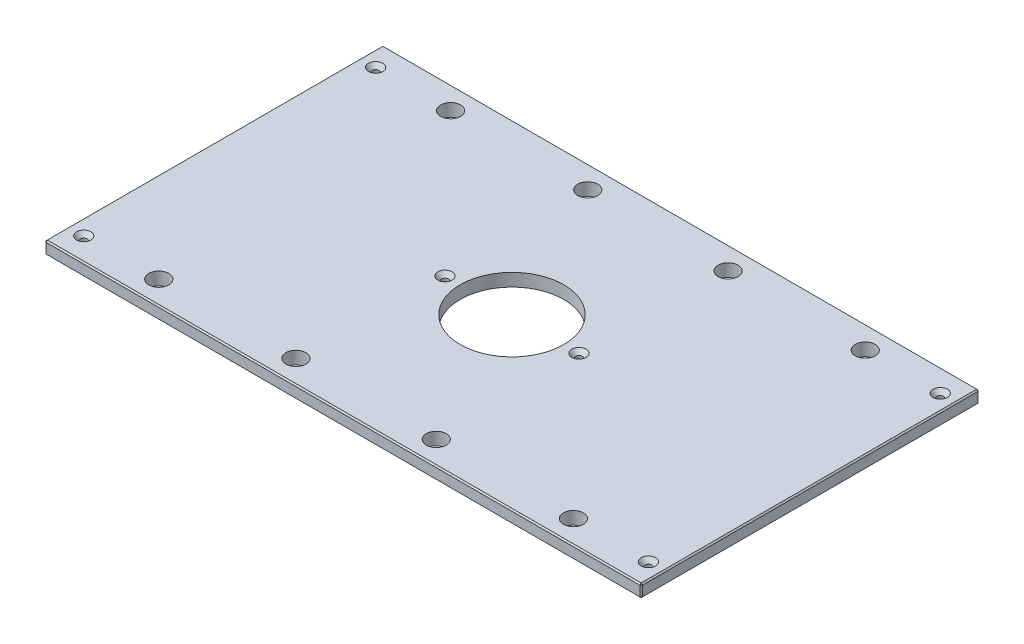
ISO-10303-21;
HEADER;
FILE_DESCRIPTION(('STEP AP214'),'2;1');
FILE_NAME('part.step','',(''),(''),'','','');
FILE_SCHEMA(('AUTOMOTIVE_DESIGN { 1 0 10303 214 1 1 1 1 }'));
ENDSEC;
DATA;
#1=APPLICATION_CONTEXT('core data for automotive mechanical design processes');
#2=APPLICATION_PROTOCOL_DEFINITION('international standard','automotive_design',2000,#1);
#3=PRODUCT_CONTEXT('',#1,'mechanical');
#4=PRODUCT('Part','Part','',(#3));
#5=PRODUCT_RELATED_PRODUCT_CATEGORY('part','',(#4));
#6=PRODUCT_DEFINITION_FORMATION('','',#4);
#7=PRODUCT_DEFINITION_CONTEXT('part definition',#1,'design');
#8=PRODUCT_DEFINITION('design','',#6,#7);
#9=PRODUCT_DEFINITION_SHAPE('','',#8);
#10=(LENGTH_UNIT() NAMED_UNIT(*) SI_UNIT(.MILLI.,.METRE.));
#11=(NAMED_UNIT(*) PLANE_ANGLE_UNIT() SI_UNIT($,.RADIAN.));
#12=(NAMED_UNIT(*) SI_UNIT($,.STERADIAN.) SOLID_ANGLE_UNIT());
#13=UNCERTAINTY_MEASURE_WITH_UNIT(LENGTH_MEASURE(1.E-05),#10,'distance_accuracy_value','');
#14=(GEOMETRIC_REPRESENTATION_CONTEXT(3) GLOBAL_UNCERTAINTY_ASSIGNED_CONTEXT((#13)) GLOBAL_UNIT_ASSIGNED_CONTEXT((#10,
#11,#12)) REPRESENTATION_CONTEXT('',''));
#15=CARTESIAN_POINT('',(0.,0.,0.));
#16=DIRECTION('',(0.,0.,1.));
#17=DIRECTION('',(1.,0.,0.));
#18=AXIS2_PLACEMENT_3D('',#15,#16,#17);
#19=CARTESIAN_POINT('',(-296.8625,12.7,-168.275));
#20=DIRECTION('',(1.,0.,0.));
#21=DIRECTION('',(0.,0.,-1.));
#22=AXIS2_PLACEMENT_3D('',#19,#20,#21);
#23=PLANE('',#22);
#24=DIRECTION('',(0.,0.,-1.));
#25=VECTOR('',#24,1.);
#26=CARTESIAN_POINT('',(-296.8625,11.43,-168.275));
#27=LINE('',#26,#25);
#28=CARTESIAN_POINT('',(-296.8625,11.43,167.005));
#29=VERTEX_POINT('',#28);
#30=CARTESIAN_POINT('',(-296.8625,11.43,-167.005));
#31=VERTEX_POINT('',#30);
#32=EDGE_CURVE('E135',#29,#31,#27,.T.);
#33=ORIENTED_EDGE('',*,*,#32,.T.);
#34=DIRECTION('',(0.,-1.,0.));
#35=VECTOR('',#34,1.);
#36=CARTESIAN_POINT('',(-296.8625,12.7,-167.005));
#37=LINE('',#36,#35);
#38=CARTESIAN_POINT('',(-296.8625,1.26999999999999,-167.005));
#39=VERTEX_POINT('',#38);
#40=EDGE_CURVE('E131',#31,#39,#37,.T.);
#41=ORIENTED_EDGE('',*,*,#40,.T.);
#42=DIRECTION('',(0.,0.,1.));
#43=VECTOR('',#42,1.);
#44=CARTESIAN_POINT('',(-296.8625,1.26999999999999,-168.275));
#45=LINE('',#44,#43);
#46=CARTESIAN_POINT('',(-296.8625,1.26999999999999,167.005));
#47=VERTEX_POINT('',#46);
#48=EDGE_CURVE('E126',#39,#47,#45,.T.);
#49=ORIENTED_EDGE('',*,*,#48,.T.);
#50=DIRECTION('',(0.,1.,0.));
#51=VECTOR('',#50,1.);
#52=CARTESIAN_POINT('',(-296.8625,12.7,167.005));
#53=LINE('',#52,#51);
#54=EDGE_CURVE('E128',#47,#29,#53,.T.);
#55=ORIENTED_EDGE('',*,*,#54,.T.);
#56=EDGE_LOOP('',(#33,#41,#49,#55));
#57=FACE_BOUND('',#56,.T.);
#58=ADVANCED_FACE('F35',(#57),#23,.F.);
#59=CARTESIAN_POINT('',(-296.8625,12.7,168.275));
#60=DIRECTION('',(0.,0.,-1.));
#61=DIRECTION('',(-1.,0.,0.));
#62=AXIS2_PLACEMENT_3D('',#59,#60,#61);
#63=PLANE('',#62);
#64=DIRECTION('',(1.,0.,0.));
#65=VECTOR('',#64,1.);
#66=CARTESIAN_POINT('',(-296.8625,1.26999999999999,168.275));
#67=LINE('',#66,#65);
#68=CARTESIAN_POINT('',(-295.5925,1.26999999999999,168.275));
#69=VERTEX_POINT('',#68);
#70=CARTESIAN_POINT('',(295.5925,1.26999999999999,168.275));
#71=VERTEX_POINT('',#70);
#72=EDGE_CURVE('E58',#69,#71,#67,.T.);
#73=ORIENTED_EDGE('',*,*,#72,.T.);
#74=DIRECTION('',(0.,1.,0.));
#75=VECTOR('',#74,1.);
#76=CARTESIAN_POINT('',(295.5925,12.7,168.275));
#77=LINE('',#76,#75);
#78=CARTESIAN_POINT('',(295.5925,11.43,168.275));
#79=VERTEX_POINT('',#78);
#80=EDGE_CURVE('E11',#71,#79,#77,.T.);
#81=ORIENTED_EDGE('',*,*,#80,.T.);
#82=DIRECTION('',(-1.,0.,0.));
#83=VECTOR('',#82,1.);
#84=CARTESIAN_POINT('',(-296.8625,11.43,168.275));
#85=LINE('',#84,#83);
#86=CARTESIAN_POINT('',(-295.5925,11.43,168.275));
#87=VERTEX_POINT('',#86);
#88=EDGE_CURVE('E44',#79,#87,#85,.T.);
#89=ORIENTED_EDGE('',*,*,#88,.T.);
#90=DIRECTION('',(0.,-1.,0.));
#91=VECTOR('',#90,1.);
#92=CARTESIAN_POINT('',(-295.5925,12.7,168.275));
#93=LINE('',#92,#91);
#94=EDGE_CURVE('E303',#87,#69,#93,.T.);
#95=ORIENTED_EDGE('',*,*,#94,.T.);
#96=EDGE_LOOP('',(#73,#81,#89,#95));
#97=FACE_BOUND('',#96,.T.);
#98=ADVANCED_FACE('F372',(#97),#63,.F.);
#99=CARTESIAN_POINT('',(296.8625,12.7,-168.275));
#100=DIRECTION('',(-1.,0.,0.));
#101=DIRECTION('',(0.,0.,1.));
#102=AXIS2_PLACEMENT_3D('',#99,#100,#101);
#103=PLANE('',#102);
#104=DIRECTION('',(0.,0.,-1.));
#105=VECTOR('',#104,1.);
#106=CARTESIAN_POINT('',(296.8625,1.26999999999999,-168.275));
#107=LINE('',#106,#105);
#108=CARTESIAN_POINT('',(296.8625,1.26999999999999,167.005));
#109=VERTEX_POINT('',#108);
#110=CARTESIAN_POINT('',(296.8625,1.26999999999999,-167.005));
#111=VERTEX_POINT('',#110);
#112=EDGE_CURVE('E298',#109,#111,#107,.T.);
#113=ORIENTED_EDGE('',*,*,#112,.T.);
#114=DIRECTION('',(0.,1.,0.));
#115=VECTOR('',#114,1.);
#116=CARTESIAN_POINT('',(296.8625,12.7,-167.005));
#117=LINE('',#116,#115);
#118=CARTESIAN_POINT('',(296.8625,11.43,-167.005));
#119=VERTEX_POINT('',#118);
#120=EDGE_CURVE('E300',#111,#119,#117,.T.);
#121=ORIENTED_EDGE('',*,*,#120,.T.);
#122=DIRECTION('',(0.,0.,1.));
#123=VECTOR('',#122,1.);
#124=CARTESIAN_POINT('',(296.8625,11.43,168.275));
#125=LINE('',#124,#123);
#126=CARTESIAN_POINT('',(296.8625,11.43,167.005));
#127=VERTEX_POINT('',#126);
#128=EDGE_CURVE('E296',#119,#127,#125,.T.);
#129=ORIENTED_EDGE('',*,*,#128,.T.);
#130=DIRECTION('',(0.,-1.,0.));
#131=VECTOR('',#130,1.);
#132=CARTESIAN_POINT('',(296.8625,12.7,167.005));
#133=LINE('',#132,#131);
#134=EDGE_CURVE('E294',#127,#109,#133,.T.);
#135=ORIENTED_EDGE('',*,*,#134,.T.);
#136=EDGE_LOOP('',(#113,#121,#129,#135));
#137=FACE_BOUND('',#136,.T.);
#138=ADVANCED_FACE('F359',(#137),#103,.F.);
#139=CARTESIAN_POINT('',(-296.8625,12.7,-168.275));
#140=DIRECTION('',(0.,0.,1.));
#141=DIRECTION('',(1.,0.,0.));
#142=AXIS2_PLACEMENT_3D('',#139,#140,#141);
#143=PLANE('',#142);
#144=DIRECTION('',(-1.,0.,0.));
#145=VECTOR('',#144,1.);
#146=CARTESIAN_POINT('',(-296.8625,1.26999999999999,-168.275));
#147=LINE('',#146,#145);
#148=CARTESIAN_POINT('',(295.5925,1.26999999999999,-168.275));
#149=VERTEX_POINT('',#148);
#150=CARTESIAN_POINT('',(-295.5925,1.26999999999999,-168.275));
#151=VERTEX_POINT('',#150);
#152=EDGE_CURVE('E270',#149,#151,#147,.T.);
#153=ORIENTED_EDGE('',*,*,#152,.T.);
#154=DIRECTION('',(0.,1.,0.));
#155=VECTOR('',#154,1.);
#156=CARTESIAN_POINT('',(-295.5925,12.7,-168.275));
#157=LINE('',#156,#155);
#158=CARTESIAN_POINT('',(-295.5925,11.43,-168.275));
#159=VERTEX_POINT('',#158);
#160=EDGE_CURVE('E274',#151,#159,#157,.T.);
#161=ORIENTED_EDGE('',*,*,#160,.T.);
#162=DIRECTION('',(1.,0.,0.));
#163=VECTOR('',#162,1.);
#164=CARTESIAN_POINT('',(296.8625,11.43,-168.275));
#165=LINE('',#164,#163);
#166=CARTESIAN_POINT('',(295.5925,11.43,-168.275));
#167=VERTEX_POINT('',#166);
#168=EDGE_CURVE('E272',#159,#167,#165,.T.);
#169=ORIENTED_EDGE('',*,*,#168,.T.);
#170=DIRECTION('',(0.,-1.,0.));
#171=VECTOR('',#170,1.);
#172=CARTESIAN_POINT('',(295.5925,12.7,-168.275));
#173=LINE('',#172,#171);
#174=EDGE_CURVE('E268',#167,#149,#173,.T.);
#175=ORIENTED_EDGE('',*,*,#174,.T.);
#176=EDGE_LOOP('',(#153,#161,#169,#175));
#177=FACE_BOUND('',#176,.T.);
#178=ADVANCED_FACE('F333',(#177),#143,.F.);
#179=CARTESIAN_POINT('',(0.,12.7,0.));
#180=DIRECTION('',(0.,1.,0.));
#181=DIRECTION('',(0.,0.,1.));
#182=AXIS2_PLACEMENT_3D('',#179,#180,#181);
#183=PLANE('',#182);
#184=CARTESIAN_POINT('',(280.9875,12.7,-145.25498));
#185=DIRECTION('',(0.,1.,0.));
#186=DIRECTION('',(0.,0.,1.));
#187=AXIS2_PLACEMENT_3D('',#184,#185,#186);
#188=CIRCLE('',#187,7.13740000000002);
#189=CARTESIAN_POINT('',(280.9875,12.7,-138.11758));
#190=VERTEX_POINT('',#189);
#191=EDGE_CURVE('E816',#190,#190,#188,.T.);
#192=ORIENTED_EDGE('',*,*,#191,.F.);
#193=EDGE_LOOP('',(#192));
#194=FACE_BOUND('',#193,.T.);
#195=CARTESIAN_POINT('',(280.9875,12.7,145.25498));
#196=DIRECTION('',(0.,1.,0.));
#197=DIRECTION('',(0.,0.,1.));
#198=AXIS2_PLACEMENT_3D('',#195,#196,#197);
#199=CIRCLE('',#198,7.13740000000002);
#200=CARTESIAN_POINT('',(280.9875,12.7,152.39238));
#201=VERTEX_POINT('',#200);
#202=EDGE_CURVE('E820',#201,#201,#199,.T.);
#203=ORIENTED_EDGE('',*,*,#202,.F.);
#204=EDGE_LOOP('',(#203));
#205=FACE_BOUND('',#204,.T.);
#206=CARTESIAN_POINT('',(-280.9875,12.7,145.25498));
#207=DIRECTION('',(0.,1.,0.));
#208=DIRECTION('',(0.,0.,1.));
#209=AXIS2_PLACEMENT_3D('',#206,#207,#208);
#210=CIRCLE('',#209,7.13740000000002);
#211=CARTESIAN_POINT('',(-280.9875,12.7,152.39238));
#212=VERTEX_POINT('',#211);
#213=EDGE_CURVE('E824',#212,#212,#210,.T.);
#214=ORIENTED_EDGE('',*,*,#213,.F.);
#215=EDGE_LOOP('',(#214));
#216=FACE_BOUND('',#215,.T.);
#217=CARTESIAN_POINT('',(-66.675,12.7,0.));
#218=DIRECTION('',(0.,1.,0.));
#219=DIRECTION('',(0.,0.,1.));
#220=AXIS2_PLACEMENT_3D('',#217,#218,#219);
#221=CIRCLE('',#220,7.1374);
#222=CARTESIAN_POINT('',(-66.675,12.7,7.1374));
#223=VERTEX_POINT('',#222);
#224=EDGE_CURVE('E828',#223,#223,#221,.T.);
#225=ORIENTED_EDGE('',*,*,#224,.F.);
#226=EDGE_LOOP('',(#225));
#227=FACE_BOUND('',#226,.T.);
#228=CARTESIAN_POINT('',(66.675,12.7,0.));
#229=DIRECTION('',(0.,1.,0.));
#230=DIRECTION('',(0.,0.,1.));
#231=AXIS2_PLACEMENT_3D('',#228,#229,#230);
#232=CIRCLE('',#231,7.1374);
#233=CARTESIAN_POINT('',(66.675,12.7,7.1374));
#234=VERTEX_POINT('',#233);
#235=EDGE_CURVE('E832',#234,#234,#232,.T.);
#236=ORIENTED_EDGE('',*,*,#235,.F.);
#237=EDGE_LOOP('',(#236));
#238=FACE_BOUND('',#237,.T.);
#239=CARTESIAN_POINT('',(-280.9875,12.7,-145.25498));
#240=DIRECTION('',(0.,1.,0.));
#241=DIRECTION('',(0.,0.,1.));
#242=AXIS2_PLACEMENT_3D('',#239,#240,#241);
#243=CIRCLE('',#242,7.13740000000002);
#244=CARTESIAN_POINT('',(-280.9875,12.7,-138.11758));
#245=VERTEX_POINT('',#244);
#246=EDGE_CURVE('E835',#245,#245,#243,.T.);
#247=ORIENTED_EDGE('',*,*,#246,.F.);
#248=EDGE_LOOP('',(#247));
#249=FACE_BOUND('',#248,.T.);
#250=DIRECTION('',(0.,0.,-1.));
#251=VECTOR('',#250,1.);
#252=CARTESIAN_POINT('',(295.5925,12.7,-168.275));
#253=LINE('',#252,#251);
#254=CARTESIAN_POINT('',(295.5925,12.7,167.005));
#255=VERTEX_POINT('',#254);
#256=CARTESIAN_POINT('',(295.5925,12.7,-167.005));
#257=VERTEX_POINT('',#256);
#258=EDGE_CURVE('E281',#255,#257,#253,.T.);
#259=ORIENTED_EDGE('',*,*,#258,.T.);
#260=DIRECTION('',(-1.,0.,0.));
#261=VECTOR('',#260,1.);
#262=CARTESIAN_POINT('',(-296.8625,12.7,-167.005));
#263=LINE('',#262,#261);
#264=CARTESIAN_POINT('',(-295.5925,12.7,-167.005));
#265=VERTEX_POINT('',#264);
#266=EDGE_CURVE('E283',#257,#265,#263,.T.);
#267=ORIENTED_EDGE('',*,*,#266,.T.);
#268=DIRECTION('',(0.,0.,1.));
#269=VECTOR('',#268,1.);
#270=CARTESIAN_POINT('',(-295.5925,12.7,168.275));
#271=LINE('',#270,#269);
#272=CARTESIAN_POINT('',(-295.5925,12.7,167.005));
#273=VERTEX_POINT('',#272);
#274=EDGE_CURVE('E279',#265,#273,#271,.T.);
#275=ORIENTED_EDGE('',*,*,#274,.T.);
#276=DIRECTION('',(1.,0.,0.));
#277=VECTOR('',#276,1.);
#278=CARTESIAN_POINT('',(296.8625,12.7,167.005));
#279=LINE('',#278,#277);
#280=EDGE_CURVE('E277',#273,#255,#279,.T.);
#281=ORIENTED_EDGE('',*,*,#280,.T.);
#282=EDGE_LOOP('',(#259,#267,#275,#281));
#283=FACE_BOUND('',#282,.T.);
#284=CARTESIAN_POINT('',(206.375,12.7,-145.25498));
#285=DIRECTION('',(0.,1.,0.));
#286=DIRECTION('',(0.,0.,1.));
#287=AXIS2_PLACEMENT_3D('',#284,#285,#286);
#288=CIRCLE('',#287,9.921875);
#289=CARTESIAN_POINT('',(206.375,12.7,-135.333105));
#290=VERTEX_POINT('',#289);
#291=EDGE_CURVE('E204',#290,#290,#288,.T.);
#292=ORIENTED_EDGE('',*,*,#291,.F.);
#293=EDGE_LOOP('',(#292));
#294=FACE_BOUND('',#293,.T.);
#295=CARTESIAN_POINT('',(-206.375,12.7,-145.25498));
#296=DIRECTION('',(0.,1.,0.));
#297=DIRECTION('',(0.,0.,1.));
#298=AXIS2_PLACEMENT_3D('',#295,#296,#297);
#299=CIRCLE('',#298,9.921875);
#300=CARTESIAN_POINT('',(-206.375,12.7,-135.333105));
#301=VERTEX_POINT('',#300);
#302=EDGE_CURVE('E214',#301,#301,#299,.T.);
#303=ORIENTED_EDGE('',*,*,#302,.F.);
#304=EDGE_LOOP('',(#303));
#305=FACE_BOUND('',#304,.T.);
#306=CARTESIAN_POINT('',(206.375,12.7,145.25498));
#307=DIRECTION('',(0.,1.,0.));
#308=DIRECTION('',(0.,0.,1.));
#309=AXIS2_PLACEMENT_3D('',#306,#307,#308);
#310=CIRCLE('',#309,9.921875);
#311=CARTESIAN_POINT('',(206.375,12.7,155.176855));
#312=VERTEX_POINT('',#311);
#313=EDGE_CURVE('E225',#312,#312,#310,.T.);
#314=ORIENTED_EDGE('',*,*,#313,.F.);
#315=EDGE_LOOP('',(#314));
#316=FACE_BOUND('',#315,.T.);
#317=CARTESIAN_POINT('',(-206.375,12.7,145.25498));
#318=DIRECTION('',(0.,1.,0.));
#319=DIRECTION('',(0.,0.,1.));
#320=AXIS2_PLACEMENT_3D('',#317,#318,#319);
#321=CIRCLE('',#320,9.921875);
#322=CARTESIAN_POINT('',(-206.375,12.7,155.176855));
#323=VERTEX_POINT('',#322);
#324=EDGE_CURVE('E231',#323,#323,#321,.T.);
#325=ORIENTED_EDGE('',*,*,#324,.F.);
#326=EDGE_LOOP('',(#325));
#327=FACE_BOUND('',#326,.T.);
#328=CARTESIAN_POINT('',(-69.85,12.7,-145.25498));
#329=DIRECTION('',(0.,1.,0.));
#330=DIRECTION('',(0.,0.,1.));
#331=AXIS2_PLACEMENT_3D('',#328,#329,#330);
#332=CIRCLE('',#331,9.921875);
#333=CARTESIAN_POINT('',(-69.85,12.7,-135.333105));
#334=VERTEX_POINT('',#333);
#335=EDGE_CURVE('E237',#334,#334,#332,.T.);
#336=ORIENTED_EDGE('',*,*,#335,.F.);
#337=EDGE_LOOP('',(#336));
#338=FACE_BOUND('',#337,.T.);
#339=CARTESIAN_POINT('',(69.85,12.7,-145.25498));
#340=DIRECTION('',(0.,1.,0.));
#341=DIRECTION('',(0.,0.,1.));
#342=AXIS2_PLACEMENT_3D('',#339,#340,#341);
#343=CIRCLE('',#342,9.921875);
#344=CARTESIAN_POINT('',(69.85,12.7,-135.333105));
#345=VERTEX_POINT('',#344);
#346=EDGE_CURVE('E243',#345,#345,#343,.T.);
#347=ORIENTED_EDGE('',*,*,#346,.F.);
#348=EDGE_LOOP('',(#347));
#349=FACE_BOUND('',#348,.T.);
#350=CARTESIAN_POINT('',(69.85,12.7,145.25498));
#351=DIRECTION('',(0.,1.,0.));
#352=DIRECTION('',(0.,0.,1.));
#353=AXIS2_PLACEMENT_3D('',#350,#351,#352);
#354=CIRCLE('',#353,9.921875);
#355=CARTESIAN_POINT('',(69.85,12.7,155.176855));
#356=VERTEX_POINT('',#355);
#357=EDGE_CURVE('E249',#356,#356,#354,.T.);
#358=ORIENTED_EDGE('',*,*,#357,.F.);
#359=EDGE_LOOP('',(#358));
#360=FACE_BOUND('',#359,.T.);
#361=CARTESIAN_POINT('',(-69.85,12.7,145.25498));
#362=DIRECTION('',(0.,1.,0.));
#363=DIRECTION('',(0.,0.,1.));
#364=AXIS2_PLACEMENT_3D('',#361,#362,#363);
#365=CIRCLE('',#364,9.921875);
#366=CARTESIAN_POINT('',(-69.85,12.7,155.176855));
#367=VERTEX_POINT('',#366);
#368=EDGE_CURVE('E255',#367,#367,#365,.T.);
#369=ORIENTED_EDGE('',*,*,#368,.F.);
#370=EDGE_LOOP('',(#369));
#371=FACE_BOUND('',#370,.T.);
#372=CARTESIAN_POINT('',(0.,12.7,0.));
#373=DIRECTION('',(0.,1.,0.));
#374=DIRECTION('',(0.,0.,1.));
#375=AXIS2_PLACEMENT_3D('',#372,#373,#374);
#376=CIRCLE('',#375,51.562);
#377=CARTESIAN_POINT('',(0.,12.7,51.562));
#378=VERTEX_POINT('',#377);
#379=EDGE_CURVE('E261',#378,#378,#376,.T.);
#380=ORIENTED_EDGE('',*,*,#379,.F.);
#381=EDGE_LOOP('',(#380));
#382=FACE_BOUND('',#381,.T.);
#383=ADVANCED_FACE('F381',(#194,#205,#216,#227,#238,#249,#283,#294,#305,#316,#327,#338,#349,
#360,#371,#382),#183,.T.);
#384=CARTESIAN_POINT('',(0.,0.,0.));
#385=DIRECTION('',(0.,1.,0.));
#386=DIRECTION('',(0.,0.,1.));
#387=AXIS2_PLACEMENT_3D('',#384,#385,#386);
#388=PLANE('',#387);
#389=CARTESIAN_POINT('',(280.9875,0.,-145.25498));
#390=DIRECTION('',(0.,1.,0.));
#391=DIRECTION('',(0.,0.,1.));
#392=AXIS2_PLACEMENT_3D('',#389,#390,#391);
#393=CIRCLE('',#392,3.3782);
#394=CARTESIAN_POINT('',(280.9875,0.,-141.87678));
#395=VERTEX_POINT('',#394);
#396=EDGE_CURVE('E869',#395,#395,#393,.T.);
#397=ORIENTED_EDGE('',*,*,#396,.T.);
#398=EDGE_LOOP('',(#397));
#399=FACE_BOUND('',#398,.T.);
#400=CARTESIAN_POINT('',(280.9875,0.,145.25498));
#401=DIRECTION('',(0.,1.,0.));
#402=DIRECTION('',(0.,0.,1.));
#403=AXIS2_PLACEMENT_3D('',#400,#401,#402);
#404=CIRCLE('',#403,3.3782);
#405=CARTESIAN_POINT('',(280.9875,0.,148.63318));
#406=VERTEX_POINT('',#405);
#407=EDGE_CURVE('E862',#406,#406,#404,.T.);
#408=ORIENTED_EDGE('',*,*,#407,.T.);
#409=EDGE_LOOP('',(#408));
#410=FACE_BOUND('',#409,.T.);
#411=CARTESIAN_POINT('',(-280.9875,0.,145.25498));
#412=DIRECTION('',(0.,1.,0.));
#413=DIRECTION('',(0.,0.,1.));
#414=AXIS2_PLACEMENT_3D('',#411,#412,#413);
#415=CIRCLE('',#414,3.3782);
#416=CARTESIAN_POINT('',(-280.9875,0.,148.63318));
#417=VERTEX_POINT('',#416);
#418=EDGE_CURVE('E855',#417,#417,#415,.T.);
#419=ORIENTED_EDGE('',*,*,#418,.T.);
#420=EDGE_LOOP('',(#419));
#421=FACE_BOUND('',#420,.T.);
#422=CARTESIAN_POINT('',(-66.675,0.,0.));
#423=DIRECTION('',(0.,1.,0.));
#424=DIRECTION('',(0.,0.,1.));
#425=AXIS2_PLACEMENT_3D('',#422,#423,#424);
#426=CIRCLE('',#425,3.3782);
#427=CARTESIAN_POINT('',(-66.675,0.,3.3782));
#428=VERTEX_POINT('',#427);
#429=EDGE_CURVE('E848',#428,#428,#426,.T.);
#430=ORIENTED_EDGE('',*,*,#429,.T.);
#431=EDGE_LOOP('',(#430));
#432=FACE_BOUND('',#431,.T.);
#433=CARTESIAN_POINT('',(66.675,0.,0.));
#434=DIRECTION('',(0.,1.,0.));
#435=DIRECTION('',(0.,0.,1.));
#436=AXIS2_PLACEMENT_3D('',#433,#434,#435);
#437=CIRCLE('',#436,3.3782);
#438=CARTESIAN_POINT('',(66.675,0.,3.3782));
#439=VERTEX_POINT('',#438);
#440=EDGE_CURVE('E838',#439,#439,#437,.T.);
#441=ORIENTED_EDGE('',*,*,#440,.T.);
#442=EDGE_LOOP('',(#441));
#443=FACE_BOUND('',#442,.T.);
#444=CARTESIAN_POINT('',(-280.9875,0.,-145.25498));
#445=DIRECTION('',(0.,1.,0.));
#446=DIRECTION('',(0.,0.,1.));
#447=AXIS2_PLACEMENT_3D('',#444,#445,#446);
#448=CIRCLE('',#447,3.3782);
#449=CARTESIAN_POINT('',(-280.9875,0.,-141.87678));
#450=VERTEX_POINT('',#449);
#451=EDGE_CURVE('E217',#450,#450,#448,.T.);
#452=ORIENTED_EDGE('',*,*,#451,.T.);
#453=EDGE_LOOP('',(#452));
#454=FACE_BOUND('',#453,.T.);
#455=DIRECTION('',(0.,0.,-1.));
#456=VECTOR('',#455,1.);
#457=CARTESIAN_POINT('',(-295.5925,0.,0.));
#458=LINE('',#457,#456);
#459=CARTESIAN_POINT('',(-295.5925,0.,167.005));
#460=VERTEX_POINT('',#459);
#461=CARTESIAN_POINT('',(-295.5925,0.,-167.005));
#462=VERTEX_POINT('',#461);
#463=EDGE_CURVE('E158',#460,#462,#458,.T.);
#464=ORIENTED_EDGE('',*,*,#463,.T.);
#465=DIRECTION('',(1.,0.,0.));
#466=VECTOR('',#465,1.);
#467=CARTESIAN_POINT('',(0.,0.,-167.005));
#468=LINE('',#467,#466);
#469=CARTESIAN_POINT('',(295.5925,0.,-167.005));
#470=VERTEX_POINT('',#469);
#471=EDGE_CURVE('E291',#462,#470,#468,.T.);
#472=ORIENTED_EDGE('',*,*,#471,.T.);
#473=DIRECTION('',(0.,0.,1.));
#474=VECTOR('',#473,1.);
#475=CARTESIAN_POINT('',(295.5925,0.,0.));
#476=LINE('',#475,#474);
#477=CARTESIAN_POINT('',(295.5925,0.,167.005));
#478=VERTEX_POINT('',#477);
#479=EDGE_CURVE('E289',#470,#478,#476,.T.);
#480=ORIENTED_EDGE('',*,*,#479,.T.);
#481=DIRECTION('',(-1.,0.,0.));
#482=VECTOR('',#481,1.);
#483=CARTESIAN_POINT('',(0.,0.,167.005));
#484=LINE('',#483,#482);
#485=EDGE_CURVE('E286',#478,#460,#484,.T.);
#486=ORIENTED_EDGE('',*,*,#485,.T.);
#487=EDGE_LOOP('',(#464,#472,#480,#486));
#488=FACE_BOUND('',#487,.T.);
#489=CARTESIAN_POINT('',(206.375,0.,-145.25498));
#490=DIRECTION('',(0.,1.,0.));
#491=DIRECTION('',(0.,0.,1.));
#492=AXIS2_PLACEMENT_3D('',#489,#490,#491);
#493=CIRCLE('',#492,9.921875);
#494=CARTESIAN_POINT('',(206.375,0.,-135.333105));
#495=VERTEX_POINT('',#494);
#496=EDGE_CURVE('E209',#495,#495,#493,.T.);
#497=ORIENTED_EDGE('',*,*,#496,.T.);
#498=EDGE_LOOP('',(#497));
#499=FACE_BOUND('',#498,.T.);
#500=CARTESIAN_POINT('',(-206.375,0.,-145.25498));
#501=DIRECTION('',(0.,1.,0.));
#502=DIRECTION('',(0.,0.,1.));
#503=AXIS2_PLACEMENT_3D('',#500,#501,#502);
#504=CIRCLE('',#503,9.921875);
#505=CARTESIAN_POINT('',(-206.375,0.,-135.333105));
#506=VERTEX_POINT('',#505);
#507=EDGE_CURVE('E222',#506,#506,#504,.T.);
#508=ORIENTED_EDGE('',*,*,#507,.T.);
#509=EDGE_LOOP('',(#508));
#510=FACE_BOUND('',#509,.T.);
#511=CARTESIAN_POINT('',(206.375,0.,145.25498));
#512=DIRECTION('',(0.,1.,0.));
#513=DIRECTION('',(0.,0.,1.));
#514=AXIS2_PLACEMENT_3D('',#511,#512,#513);
#515=CIRCLE('',#514,9.921875);
#516=CARTESIAN_POINT('',(206.375,0.,155.176855));
#517=VERTEX_POINT('',#516);
#518=EDGE_CURVE('E228',#517,#517,#515,.T.);
#519=ORIENTED_EDGE('',*,*,#518,.T.);
#520=EDGE_LOOP('',(#519));
#521=FACE_BOUND('',#520,.T.);
#522=CARTESIAN_POINT('',(-206.375,0.,145.25498));
#523=DIRECTION('',(0.,1.,0.));
#524=DIRECTION('',(0.,0.,1.));
#525=AXIS2_PLACEMENT_3D('',#522,#523,#524);
#526=CIRCLE('',#525,9.921875);
#527=CARTESIAN_POINT('',(-206.375,0.,155.176855));
#528=VERTEX_POINT('',#527);
#529=EDGE_CURVE('E234',#528,#528,#526,.T.);
#530=ORIENTED_EDGE('',*,*,#529,.T.);
#531=EDGE_LOOP('',(#530));
#532=FACE_BOUND('',#531,.T.);
#533=CARTESIAN_POINT('',(-69.85,0.,-145.25498));
#534=DIRECTION('',(0.,1.,0.));
#535=DIRECTION('',(0.,0.,1.));
#536=AXIS2_PLACEMENT_3D('',#533,#534,#535);
#537=CIRCLE('',#536,9.921875);
#538=CARTESIAN_POINT('',(-69.85,0.,-135.333105));
#539=VERTEX_POINT('',#538);
#540=EDGE_CURVE('E240',#539,#539,#537,.T.);
#541=ORIENTED_EDGE('',*,*,#540,.T.);
#542=EDGE_LOOP('',(#541));
#543=FACE_BOUND('',#542,.T.);
#544=CARTESIAN_POINT('',(69.85,0.,-145.25498));
#545=DIRECTION('',(0.,1.,0.));
#546=DIRECTION('',(0.,0.,1.));
#547=AXIS2_PLACEMENT_3D('',#544,#545,#546);
#548=CIRCLE('',#547,9.921875);
#549=CARTESIAN_POINT('',(69.85,0.,-135.333105));
#550=VERTEX_POINT('',#549);
#551=EDGE_CURVE('E246',#550,#550,#548,.T.);
#552=ORIENTED_EDGE('',*,*,#551,.T.);
#553=EDGE_LOOP('',(#552));
#554=FACE_BOUND('',#553,.T.);
#555=CARTESIAN_POINT('',(69.85,0.,145.25498));
#556=DIRECTION('',(0.,1.,0.));
#557=DIRECTION('',(0.,0.,1.));
#558=AXIS2_PLACEMENT_3D('',#555,#556,#557);
#559=CIRCLE('',#558,9.921875);
#560=CARTESIAN_POINT('',(69.85,0.,155.176855));
#561=VERTEX_POINT('',#560);
#562=EDGE_CURVE('E252',#561,#561,#559,.T.);
#563=ORIENTED_EDGE('',*,*,#562,.T.);
#564=EDGE_LOOP('',(#563));
#565=FACE_BOUND('',#564,.T.);
#566=CARTESIAN_POINT('',(-69.85,0.,145.25498));
#567=DIRECTION('',(0.,1.,0.));
#568=DIRECTION('',(0.,0.,1.));
#569=AXIS2_PLACEMENT_3D('',#566,#567,#568);
#570=CIRCLE('',#569,9.921875);
#571=CARTESIAN_POINT('',(-69.85,0.,155.176855));
#572=VERTEX_POINT('',#571);
#573=EDGE_CURVE('E258',#572,#572,#570,.T.);
#574=ORIENTED_EDGE('',*,*,#573,.T.);
#575=EDGE_LOOP('',(#574));
#576=FACE_BOUND('',#575,.T.);
#577=CARTESIAN_POINT('',(0.,0.,0.));
#578=DIRECTION('',(0.,1.,0.));
#579=DIRECTION('',(0.,0.,1.));
#580=AXIS2_PLACEMENT_3D('',#577,#578,#579);
#581=CIRCLE('',#580,51.562);
#582=CARTESIAN_POINT('',(0.,0.,51.562));
#583=VERTEX_POINT('',#582);
#584=EDGE_CURVE('E147',#583,#583,#581,.T.);
#585=ORIENTED_EDGE('',*,*,#584,.T.);
#586=EDGE_LOOP('',(#585));
#587=FACE_BOUND('',#586,.T.);
#588=ADVANCED_FACE('F346',(#399,#410,#421,#432,#443,#454,#488,#499,#510,#521,#532,#543,#554,
#565,#576,#587),#388,.F.);
#589=CARTESIAN_POINT('',(0.,0.,0.));
#590=DIRECTION('',(0.,1.,0.));
#591=DIRECTION('',(0.,0.,1.));
#592=AXIS2_PLACEMENT_3D('',#589,#590,#591);
#593=CYLINDRICAL_SURFACE('',#592,51.562);
#594=ORIENTED_EDGE('',*,*,#584,.F.);
#595=EDGE_LOOP('',(#594));
#596=FACE_BOUND('',#595,.T.);
#597=ORIENTED_EDGE('',*,*,#379,.T.);
#598=EDGE_LOOP('',(#597));
#599=FACE_BOUND('',#598,.T.);
#600=ADVANCED_FACE('F751',(#596,#599),#593,.F.);
#601=CARTESIAN_POINT('',(-69.85,12.7,145.25498));
#602=DIRECTION('',(0.,1.,0.));
#603=DIRECTION('',(0.,0.,1.));
#604=AXIS2_PLACEMENT_3D('',#601,#602,#603);
#605=CYLINDRICAL_SURFACE('',#604,9.921875);
#606=ORIENTED_EDGE('',*,*,#573,.F.);
#607=EDGE_LOOP('',(#606));
#608=FACE_BOUND('',#607,.T.);
#609=ORIENTED_EDGE('',*,*,#368,.T.);
#610=EDGE_LOOP('',(#609));
#611=FACE_BOUND('',#610,.T.);
#612=ADVANCED_FACE('F742',(#608,#611),#605,.F.);
#613=CARTESIAN_POINT('',(69.85,12.7,145.25498));
#614=DIRECTION('',(0.,1.,0.));
#615=DIRECTION('',(0.,0.,1.));
#616=AXIS2_PLACEMENT_3D('',#613,#614,#615);
#617=CYLINDRICAL_SURFACE('',#616,9.921875);
#618=ORIENTED_EDGE('',*,*,#562,.F.);
#619=EDGE_LOOP('',(#618));
#620=FACE_BOUND('',#619,.T.);
#621=ORIENTED_EDGE('',*,*,#357,.T.);
#622=EDGE_LOOP('',(#621));
#623=FACE_BOUND('',#622,.T.);
#624=ADVANCED_FACE('F733',(#620,#623),#617,.F.);
#625=CARTESIAN_POINT('',(69.85,12.7,-145.25498));
#626=DIRECTION('',(0.,1.,0.));
#627=DIRECTION('',(0.,0.,1.));
#628=AXIS2_PLACEMENT_3D('',#625,#626,#627);
#629=CYLINDRICAL_SURFACE('',#628,9.921875);
#630=ORIENTED_EDGE('',*,*,#551,.F.);
#631=EDGE_LOOP('',(#630));
#632=FACE_BOUND('',#631,.T.);
#633=ORIENTED_EDGE('',*,*,#346,.T.);
#634=EDGE_LOOP('',(#633));
#635=FACE_BOUND('',#634,.T.);
#636=ADVANCED_FACE('F724',(#632,#635),#629,.F.);
#637=CARTESIAN_POINT('',(-69.85,12.7,-145.25498));
#638=DIRECTION('',(0.,1.,0.));
#639=DIRECTION('',(0.,0.,1.));
#640=AXIS2_PLACEMENT_3D('',#637,#638,#639);
#641=CYLINDRICAL_SURFACE('',#640,9.921875);
#642=ORIENTED_EDGE('',*,*,#540,.F.);
#643=EDGE_LOOP('',(#642));
#644=FACE_BOUND('',#643,.T.);
#645=ORIENTED_EDGE('',*,*,#335,.T.);
#646=EDGE_LOOP('',(#645));
#647=FACE_BOUND('',#646,.T.);
#648=ADVANCED_FACE('F715',(#644,#647),#641,.F.);
#649=CARTESIAN_POINT('',(-206.375,12.7,145.25498));
#650=DIRECTION('',(0.,1.,0.));
#651=DIRECTION('',(0.,0.,1.));
#652=AXIS2_PLACEMENT_3D('',#649,#650,#651);
#653=CYLINDRICAL_SURFACE('',#652,9.921875);
#654=ORIENTED_EDGE('',*,*,#529,.F.);
#655=EDGE_LOOP('',(#654));
#656=FACE_BOUND('',#655,.T.);
#657=ORIENTED_EDGE('',*,*,#324,.T.);
#658=EDGE_LOOP('',(#657));
#659=FACE_BOUND('',#658,.T.);
#660=ADVANCED_FACE('F706',(#656,#659),#653,.F.);
#661=CARTESIAN_POINT('',(206.375,12.7,145.25498));
#662=DIRECTION('',(0.,1.,0.));
#663=DIRECTION('',(0.,0.,1.));
#664=AXIS2_PLACEMENT_3D('',#661,#662,#663);
#665=CYLINDRICAL_SURFACE('',#664,9.921875);
#666=ORIENTED_EDGE('',*,*,#518,.F.);
#667=EDGE_LOOP('',(#666));
#668=FACE_BOUND('',#667,.T.);
#669=ORIENTED_EDGE('',*,*,#313,.T.);
#670=EDGE_LOOP('',(#669));
#671=FACE_BOUND('',#670,.T.);
#672=ADVANCED_FACE('F697',(#668,#671),#665,.F.);
#673=CARTESIAN_POINT('',(-206.375,12.7,-145.25498));
#674=DIRECTION('',(0.,1.,0.));
#675=DIRECTION('',(0.,0.,1.));
#676=AXIS2_PLACEMENT_3D('',#673,#674,#675);
#677=CYLINDRICAL_SURFACE('',#676,9.921875);
#678=ORIENTED_EDGE('',*,*,#507,.F.);
#679=EDGE_LOOP('',(#678));
#680=FACE_BOUND('',#679,.T.);
#681=ORIENTED_EDGE('',*,*,#302,.T.);
#682=EDGE_LOOP('',(#681));
#683=FACE_BOUND('',#682,.T.);
#684=ADVANCED_FACE('F687',(#680,#683),#677,.F.);
#685=CARTESIAN_POINT('',(206.375,12.7,-145.25498));
#686=DIRECTION('',(0.,1.,0.));
#687=DIRECTION('',(0.,0.,1.));
#688=AXIS2_PLACEMENT_3D('',#685,#686,#687);
#689=CYLINDRICAL_SURFACE('',#688,9.921875);
#690=ORIENTED_EDGE('',*,*,#496,.F.);
#691=EDGE_LOOP('',(#690));
#692=FACE_BOUND('',#691,.T.);
#693=ORIENTED_EDGE('',*,*,#291,.T.);
#694=EDGE_LOOP('',(#693));
#695=FACE_BOUND('',#694,.T.);
#696=ADVANCED_FACE('F390',(#692,#695),#689,.F.);
#697=CARTESIAN_POINT('',(296.8625,12.7,167.005));
#698=DIRECTION('',(-0.707106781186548,0.,-0.707106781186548));
#699=DIRECTION('',(0.,-1.,0.));
#700=AXIS2_PLACEMENT_3D('',#697,#698,#699);
#701=PLANE('',#700);
#702=DIRECTION('',(-0.707106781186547,0.,0.707106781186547));
#703=VECTOR('',#702,1.);
#704=CARTESIAN_POINT('',(296.8625,11.43,167.005));
#705=LINE('',#704,#703);
#706=EDGE_CURVE('E39',#79,#127,#705,.F.);
#707=ORIENTED_EDGE('',*,*,#706,.F.);
#708=ORIENTED_EDGE('',*,*,#80,.F.);
#709=DIRECTION('',(0.707106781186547,0.,-0.707106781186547));
#710=VECTOR('',#709,1.);
#711=CARTESIAN_POINT('',(296.2275,1.26999999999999,167.64));
#712=LINE('',#711,#710);
#713=EDGE_CURVE('E197',#109,#71,#712,.F.);
#714=ORIENTED_EDGE('',*,*,#713,.F.);
#715=ORIENTED_EDGE('',*,*,#134,.F.);
#716=EDGE_LOOP('',(#707,#708,#714,#715));
#717=FACE_BOUND('',#716,.T.);
#718=ADVANCED_FACE('F37',(#717),#701,.F.);
#719=CARTESIAN_POINT('',(296.8625,11.43,167.005));
#720=DIRECTION('',(0.577350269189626,0.577350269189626,0.577350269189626));
#721=DIRECTION('',(0.707106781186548,0.,-0.707106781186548));
#722=AXIS2_PLACEMENT_3D('',#719,#720,#721);
#723=PLANE('',#722);
#724=DIRECTION('',(0.,-0.707106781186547,0.707106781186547));
#725=VECTOR('',#724,1.);
#726=CARTESIAN_POINT('',(295.5925,12.065,167.64));
#727=LINE('',#726,#725);
#728=EDGE_CURVE('E193',#79,#255,#727,.F.);
#729=ORIENTED_EDGE('',*,*,#728,.F.);
#730=ORIENTED_EDGE('',*,*,#706,.T.);
#731=DIRECTION('',(-0.707106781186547,0.707106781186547,0.));
#732=VECTOR('',#731,1.);
#733=CARTESIAN_POINT('',(296.8625,11.43,167.005));
#734=LINE('',#733,#732);
#735=EDGE_CURVE('E195',#255,#127,#734,.F.);
#736=ORIENTED_EDGE('',*,*,#735,.F.);
#737=EDGE_LOOP('',(#729,#730,#736));
#738=FACE_BOUND('',#737,.T.);
#739=ADVANCED_FACE('F383',(#738),#723,.T.);
#740=CARTESIAN_POINT('',(295.5925,0.,167.005));
#741=DIRECTION('',(0.577350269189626,-0.577350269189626,0.577350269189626));
#742=DIRECTION('',(0.707106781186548,0.,-0.707106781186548));
#743=AXIS2_PLACEMENT_3D('',#740,#741,#742);
#744=PLANE('',#743);
#745=DIRECTION('',(-0.707106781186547,-0.707106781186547,0.));
#746=VECTOR('',#745,1.);
#747=CARTESIAN_POINT('',(295.5925,0.,167.005));
#748=LINE('',#747,#746);
#749=EDGE_CURVE('E187',#109,#478,#748,.T.);
#750=ORIENTED_EDGE('',*,*,#749,.F.);
#751=ORIENTED_EDGE('',*,*,#713,.T.);
#752=DIRECTION('',(0.,0.707106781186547,0.707106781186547));
#753=VECTOR('',#752,1.);
#754=CARTESIAN_POINT('',(295.5925,0.,167.005));
#755=LINE('',#754,#753);
#756=EDGE_CURVE('E190',#478,#71,#755,.T.);
#757=ORIENTED_EDGE('',*,*,#756,.F.);
#758=EDGE_LOOP('',(#750,#751,#757));
#759=FACE_BOUND('',#758,.T.);
#760=ADVANCED_FACE('F352',(#759),#744,.T.);
#761=CARTESIAN_POINT('',(295.5925,12.7,0.));
#762=DIRECTION('',(0.707106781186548,0.707106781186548,0.));
#763=DIRECTION('',(0.,0.,1.));
#764=AXIS2_PLACEMENT_3D('',#761,#762,#763);
#765=PLANE('',#764);
#766=ORIENTED_EDGE('',*,*,#735,.T.);
#767=ORIENTED_EDGE('',*,*,#128,.F.);
#768=DIRECTION('',(0.707106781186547,-0.707106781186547,0.));
#769=VECTOR('',#768,1.);
#770=CARTESIAN_POINT('',(296.2275,12.065,-167.005));
#771=LINE('',#770,#769);
#772=EDGE_CURVE('E182',#257,#119,#771,.T.);
#773=ORIENTED_EDGE('',*,*,#772,.F.);
#774=ORIENTED_EDGE('',*,*,#258,.F.);
#775=EDGE_LOOP('',(#766,#767,#773,#774));
#776=FACE_BOUND('',#775,.T.);
#777=ADVANCED_FACE('F369',(#776),#765,.T.);
#778=CARTESIAN_POINT('',(0.,12.7,167.005));
#779=DIRECTION('',(0.,0.707106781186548,0.707106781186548));
#780=DIRECTION('',(-1.,0.,0.));
#781=AXIS2_PLACEMENT_3D('',#778,#779,#780);
#782=PLANE('',#781);
#783=ORIENTED_EDGE('',*,*,#728,.T.);
#784=ORIENTED_EDGE('',*,*,#280,.F.);
#785=DIRECTION('',(0.,0.707106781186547,-0.707106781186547));
#786=VECTOR('',#785,1.);
#787=CARTESIAN_POINT('',(-295.5925,12.7,167.005));
#788=LINE('',#787,#786);
#789=EDGE_CURVE('E179',#87,#273,#788,.T.);
#790=ORIENTED_EDGE('',*,*,#789,.F.);
#791=ORIENTED_EDGE('',*,*,#88,.F.);
#792=EDGE_LOOP('',(#783,#784,#790,#791));
#793=FACE_BOUND('',#792,.T.);
#794=ADVANCED_FACE('F374',(#793),#782,.T.);
#795=CARTESIAN_POINT('',(-295.5925,12.7,168.275));
#796=DIRECTION('',(0.707106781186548,0.,-0.707106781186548));
#797=DIRECTION('',(0.,-1.,0.));
#798=AXIS2_PLACEMENT_3D('',#795,#796,#797);
#799=PLANE('',#798);
#800=DIRECTION('',(0.707106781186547,0.,0.707106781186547));
#801=VECTOR('',#800,1.);
#802=CARTESIAN_POINT('',(-296.8625,1.26999999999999,167.005));
#803=LINE('',#802,#801);
#804=EDGE_CURVE('E142',#69,#47,#803,.F.);
#805=ORIENTED_EDGE('',*,*,#804,.F.);
#806=ORIENTED_EDGE('',*,*,#94,.F.);
#807=DIRECTION('',(-0.707106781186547,0.,-0.707106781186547));
#808=VECTOR('',#807,1.);
#809=CARTESIAN_POINT('',(-296.2275,11.43,167.64));
#810=LINE('',#809,#808);
#811=EDGE_CURVE('E145',#29,#87,#810,.F.);
#812=ORIENTED_EDGE('',*,*,#811,.F.);
#813=ORIENTED_EDGE('',*,*,#54,.F.);
#814=EDGE_LOOP('',(#805,#806,#812,#813));
#815=FACE_BOUND('',#814,.T.);
#816=ADVANCED_FACE('F140',(#815),#799,.F.);
#817=CARTESIAN_POINT('',(-296.8625,1.26999999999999,168.275));
#818=DIRECTION('',(0.,0.707106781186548,-0.707106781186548));
#819=DIRECTION('',(1.,0.,0.));
#820=AXIS2_PLACEMENT_3D('',#817,#818,#819);
#821=PLANE('',#820);
#822=ORIENTED_EDGE('',*,*,#756,.T.);
#823=ORIENTED_EDGE('',*,*,#72,.F.);
#824=DIRECTION('',(0.,-0.707106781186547,-0.707106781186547));
#825=VECTOR('',#824,1.);
#826=CARTESIAN_POINT('',(-295.5925,0.634999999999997,167.64));
#827=LINE('',#826,#825);
#828=EDGE_CURVE('E155',#460,#69,#827,.F.);
#829=ORIENTED_EDGE('',*,*,#828,.F.);
#830=ORIENTED_EDGE('',*,*,#485,.F.);
#831=EDGE_LOOP('',(#822,#823,#829,#830));
#832=FACE_BOUND('',#831,.T.);
#833=ADVANCED_FACE('F351',(#832),#821,.F.);
#834=CARTESIAN_POINT('',(296.8625,1.26999999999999,-168.275));
#835=DIRECTION('',(-0.707106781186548,0.707106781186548,0.));
#836=DIRECTION('',(0.,0.,-1.));
#837=AXIS2_PLACEMENT_3D('',#834,#835,#836);
#838=PLANE('',#837);
#839=ORIENTED_EDGE('',*,*,#749,.T.);
#840=ORIENTED_EDGE('',*,*,#479,.F.);
#841=DIRECTION('',(0.707106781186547,0.707106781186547,0.));
#842=VECTOR('',#841,1.);
#843=CARTESIAN_POINT('',(295.5925,0.,-167.005));
#844=LINE('',#843,#842);
#845=EDGE_CURVE('E174',#111,#470,#844,.F.);
#846=ORIENTED_EDGE('',*,*,#845,.F.);
#847=ORIENTED_EDGE('',*,*,#112,.F.);
#848=EDGE_LOOP('',(#839,#840,#846,#847));
#849=FACE_BOUND('',#848,.T.);
#850=ADVANCED_FACE('F356',(#849),#838,.F.);
#851=CARTESIAN_POINT('',(295.5925,12.7,-168.275));
#852=DIRECTION('',(-0.707106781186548,0.,0.707106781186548));
#853=DIRECTION('',(0.,-1.,0.));
#854=AXIS2_PLACEMENT_3D('',#851,#852,#853);
#855=PLANE('',#854);
#856=DIRECTION('',(0.707106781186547,0.,0.707106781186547));
#857=VECTOR('',#856,1.);
#858=CARTESIAN_POINT('',(295.5925,11.43,-168.275));
#859=LINE('',#858,#857);
#860=EDGE_CURVE('E184',#119,#167,#859,.F.);
#861=ORIENTED_EDGE('',*,*,#860,.F.);
#862=ORIENTED_EDGE('',*,*,#120,.F.);
#863=DIRECTION('',(-0.707106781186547,0.,-0.707106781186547));
#864=VECTOR('',#863,1.);
#865=CARTESIAN_POINT('',(296.2275,1.26999999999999,-167.64));
#866=LINE('',#865,#864);
#867=EDGE_CURVE('E171',#149,#111,#866,.F.);
#868=ORIENTED_EDGE('',*,*,#867,.F.);
#869=ORIENTED_EDGE('',*,*,#174,.F.);
#870=EDGE_LOOP('',(#861,#862,#868,#869));
#871=FACE_BOUND('',#870,.T.);
#872=ADVANCED_FACE('F364',(#871),#855,.F.);
#873=CARTESIAN_POINT('',(295.5925,11.43,-168.275));
#874=DIRECTION('',(0.577350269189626,0.577350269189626,-0.577350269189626));
#875=DIRECTION('',(-0.707106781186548,0.,-0.707106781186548));
#876=AXIS2_PLACEMENT_3D('',#873,#874,#875);
#877=PLANE('',#876);
#878=ORIENTED_EDGE('',*,*,#772,.T.);
#879=ORIENTED_EDGE('',*,*,#860,.T.);
#880=DIRECTION('',(0.,0.707106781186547,0.707106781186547));
#881=VECTOR('',#880,1.);
#882=CARTESIAN_POINT('',(295.5925,11.43,-168.275));
#883=LINE('',#882,#881);
#884=EDGE_CURVE('E163',#257,#167,#883,.F.);
#885=ORIENTED_EDGE('',*,*,#884,.F.);
#886=EDGE_LOOP('',(#878,#879,#885));
#887=FACE_BOUND('',#886,.T.);
#888=ADVANCED_FACE('F422',(#887),#877,.T.);
#889=CARTESIAN_POINT('',(-295.5925,12.7,167.005));
#890=DIRECTION('',(-0.577350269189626,0.577350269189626,0.577350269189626));
#891=DIRECTION('',(0.707106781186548,0.,0.707106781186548));
#892=AXIS2_PLACEMENT_3D('',#889,#890,#891);
#893=PLANE('',#892);
#894=ORIENTED_EDGE('',*,*,#811,.T.);
#895=ORIENTED_EDGE('',*,*,#789,.T.);
#896=DIRECTION('',(-0.707106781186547,-0.707106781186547,0.));
#897=VECTOR('',#896,1.);
#898=CARTESIAN_POINT('',(-295.5925,12.7,167.005));
#899=LINE('',#898,#897);
#900=EDGE_CURVE('E159',#29,#273,#899,.F.);
#901=ORIENTED_EDGE('',*,*,#900,.F.);
#902=EDGE_LOOP('',(#894,#895,#901));
#903=FACE_BOUND('',#902,.T.);
#904=ADVANCED_FACE('F376',(#903),#893,.T.);
#905=CARTESIAN_POINT('',(-296.8625,1.26999999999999,167.005));
#906=DIRECTION('',(-0.577350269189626,-0.577350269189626,0.577350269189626));
#907=DIRECTION('',(0.707106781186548,0.,0.707106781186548));
#908=AXIS2_PLACEMENT_3D('',#905,#906,#907);
#909=PLANE('',#908);
#910=ORIENTED_EDGE('',*,*,#828,.T.);
#911=ORIENTED_EDGE('',*,*,#804,.T.);
#912=DIRECTION('',(-0.707106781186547,0.707106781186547,0.));
#913=VECTOR('',#912,1.);
#914=CARTESIAN_POINT('',(-296.8625,1.26999999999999,167.005));
#915=LINE('',#914,#913);
#916=EDGE_CURVE('E152',#460,#47,#915,.T.);
#917=ORIENTED_EDGE('',*,*,#916,.F.);
#918=EDGE_LOOP('',(#910,#911,#917));
#919=FACE_BOUND('',#918,.T.);
#920=ADVANCED_FACE('F151',(#919),#909,.T.);
#921=CARTESIAN_POINT('',(295.5925,0.,-167.005));
#922=DIRECTION('',(0.577350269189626,-0.577350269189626,-0.577350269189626));
#923=DIRECTION('',(-0.707106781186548,0.,-0.707106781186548));
#924=AXIS2_PLACEMENT_3D('',#921,#922,#923);
#925=PLANE('',#924);
#926=ORIENTED_EDGE('',*,*,#867,.T.);
#927=ORIENTED_EDGE('',*,*,#845,.T.);
#928=DIRECTION('',(0.,-0.707106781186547,0.707106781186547));
#929=VECTOR('',#928,1.);
#930=CARTESIAN_POINT('',(295.5925,0.,-167.005));
#931=LINE('',#930,#929);
#932=EDGE_CURVE('E160',#149,#470,#931,.T.);
#933=ORIENTED_EDGE('',*,*,#932,.F.);
#934=EDGE_LOOP('',(#926,#927,#933));
#935=FACE_BOUND('',#934,.T.);
#936=ADVANCED_FACE('F414',(#935),#925,.T.);
#937=CARTESIAN_POINT('',(0.,12.7,-167.005));
#938=DIRECTION('',(0.,0.707106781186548,-0.707106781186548));
#939=DIRECTION('',(1.,0.,0.));
#940=AXIS2_PLACEMENT_3D('',#937,#938,#939);
#941=PLANE('',#940);
#942=ORIENTED_EDGE('',*,*,#884,.T.);
#943=ORIENTED_EDGE('',*,*,#168,.F.);
#944=DIRECTION('',(0.,-0.707106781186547,-0.707106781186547));
#945=VECTOR('',#944,1.);
#946=CARTESIAN_POINT('',(-295.5925,11.43,-168.275));
#947=LINE('',#946,#945);
#948=EDGE_CURVE('E165',#265,#159,#947,.T.);
#949=ORIENTED_EDGE('',*,*,#948,.F.);
#950=ORIENTED_EDGE('',*,*,#266,.F.);
#951=EDGE_LOOP('',(#942,#943,#949,#950));
#952=FACE_BOUND('',#951,.T.);
#953=ADVANCED_FACE('F328',(#952),#941,.T.);
#954=CARTESIAN_POINT('',(-295.5925,12.7,0.));
#955=DIRECTION('',(-0.707106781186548,0.707106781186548,0.));
#956=DIRECTION('',(0.,0.,-1.));
#957=AXIS2_PLACEMENT_3D('',#954,#955,#956);
#958=PLANE('',#957);
#959=ORIENTED_EDGE('',*,*,#900,.T.);
#960=ORIENTED_EDGE('',*,*,#274,.F.);
#961=DIRECTION('',(0.707106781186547,0.707106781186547,0.));
#962=VECTOR('',#961,1.);
#963=CARTESIAN_POINT('',(-296.2275,12.065,-167.005));
#964=LINE('',#963,#962);
#965=EDGE_CURVE('E317',#31,#265,#964,.T.);
#966=ORIENTED_EDGE('',*,*,#965,.F.);
#967=ORIENTED_EDGE('',*,*,#32,.F.);
#968=EDGE_LOOP('',(#959,#960,#966,#967));
#969=FACE_BOUND('',#968,.T.);
#970=ADVANCED_FACE('F379',(#969),#958,.T.);
#971=CARTESIAN_POINT('',(-296.8625,1.26999999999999,-168.275));
#972=DIRECTION('',(0.707106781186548,0.707106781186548,0.));
#973=DIRECTION('',(0.,0.,1.));
#974=AXIS2_PLACEMENT_3D('',#971,#972,#973);
#975=PLANE('',#974);
#976=ORIENTED_EDGE('',*,*,#916,.T.);
#977=ORIENTED_EDGE('',*,*,#48,.F.);
#978=DIRECTION('',(0.707106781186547,-0.707106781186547,0.));
#979=VECTOR('',#978,1.);
#980=CARTESIAN_POINT('',(-296.8625,1.26999999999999,-167.005));
#981=LINE('',#980,#979);
#982=EDGE_CURVE('E314',#462,#39,#981,.F.);
#983=ORIENTED_EDGE('',*,*,#982,.F.);
#984=ORIENTED_EDGE('',*,*,#463,.F.);
#985=EDGE_LOOP('',(#976,#977,#983,#984));
#986=FACE_BOUND('',#985,.T.);
#987=ADVANCED_FACE('F157',(#986),#975,.F.);
#988=CARTESIAN_POINT('',(-296.8625,1.26999999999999,-168.275));
#989=DIRECTION('',(0.,0.707106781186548,0.707106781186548));
#990=DIRECTION('',(-1.,0.,0.));
#991=AXIS2_PLACEMENT_3D('',#988,#989,#990);
#992=PLANE('',#991);
#993=ORIENTED_EDGE('',*,*,#932,.T.);
#994=ORIENTED_EDGE('',*,*,#471,.F.);
#995=DIRECTION('',(0.,0.707106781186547,-0.707106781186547));
#996=VECTOR('',#995,1.);
#997=CARTESIAN_POINT('',(-295.5925,0.634999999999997,-167.64));
#998=LINE('',#997,#996);
#999=EDGE_CURVE('E311',#151,#462,#998,.F.);
#1000=ORIENTED_EDGE('',*,*,#999,.F.);
#1001=ORIENTED_EDGE('',*,*,#152,.F.);
#1002=EDGE_LOOP('',(#993,#994,#1000,#1001));
#1003=FACE_BOUND('',#1002,.T.);
#1004=ADVANCED_FACE('F343',(#1003),#992,.F.);
#1005=CARTESIAN_POINT('',(-295.5925,11.43,-168.275));
#1006=DIRECTION('',(-0.577350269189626,0.577350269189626,-0.577350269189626));
#1007=DIRECTION('',(-0.707106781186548,0.,0.707106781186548));
#1008=AXIS2_PLACEMENT_3D('',#1005,#1006,#1007);
#1009=PLANE('',#1008);
#1010=ORIENTED_EDGE('',*,*,#965,.T.);
#1011=ORIENTED_EDGE('',*,*,#948,.T.);
#1012=DIRECTION('',(0.707106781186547,0.,-0.707106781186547));
#1013=VECTOR('',#1012,1.);
#1014=CARTESIAN_POINT('',(-295.5925,11.43,-168.275));
#1015=LINE('',#1014,#1013);
#1016=EDGE_CURVE('E309',#31,#159,#1015,.T.);
#1017=ORIENTED_EDGE('',*,*,#1016,.F.);
#1018=EDGE_LOOP('',(#1010,#1011,#1017));
#1019=FACE_BOUND('',#1018,.T.);
#1020=ADVANCED_FACE('F323',(#1019),#1009,.T.);
#1021=CARTESIAN_POINT('',(-296.8625,1.26999999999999,-167.005));
#1022=DIRECTION('',(-0.577350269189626,-0.577350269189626,-0.577350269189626));
#1023=DIRECTION('',(-0.707106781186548,0.,0.707106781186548));
#1024=AXIS2_PLACEMENT_3D('',#1021,#1022,#1023);
#1025=PLANE('',#1024);
#1026=ORIENTED_EDGE('',*,*,#999,.T.);
#1027=ORIENTED_EDGE('',*,*,#982,.T.);
#1028=DIRECTION('',(-0.707106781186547,0.,0.707106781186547));
#1029=VECTOR('',#1028,1.);
#1030=CARTESIAN_POINT('',(-296.8625,1.26999999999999,-167.005));
#1031=LINE('',#1030,#1029);
#1032=EDGE_CURVE('E307',#151,#39,#1031,.T.);
#1033=ORIENTED_EDGE('',*,*,#1032,.F.);
#1034=EDGE_LOOP('',(#1026,#1027,#1033));
#1035=FACE_BOUND('',#1034,.T.);
#1036=ADVANCED_FACE('F340',(#1035),#1025,.T.);
#1037=CARTESIAN_POINT('',(-296.8625,12.7,-167.005));
#1038=DIRECTION('',(0.707106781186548,0.,0.707106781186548));
#1039=DIRECTION('',(0.,-1.,0.));
#1040=AXIS2_PLACEMENT_3D('',#1037,#1038,#1039);
#1041=PLANE('',#1040);
#1042=ORIENTED_EDGE('',*,*,#1016,.T.);
#1043=ORIENTED_EDGE('',*,*,#160,.F.);
#1044=ORIENTED_EDGE('',*,*,#1032,.T.);
#1045=ORIENTED_EDGE('',*,*,#40,.F.);
#1046=EDGE_LOOP('',(#1042,#1043,#1044,#1045));
#1047=FACE_BOUND('',#1046,.T.);
#1048=ADVANCED_FACE('F338',(#1047),#1041,.F.);
#1049=CARTESIAN_POINT('',(-280.9875,12.7,-145.25498));
#1050=DIRECTION('',(0.,1.,0.));
#1051=DIRECTION('',(0.,0.,1.));
#1052=AXIS2_PLACEMENT_3D('',#1049,#1050,#1051);
#1053=CYLINDRICAL_SURFACE('',#1052,3.3782);
#1054=ORIENTED_EDGE('',*,*,#451,.F.);
#1055=EDGE_LOOP('',(#1054));
#1056=FACE_BOUND('',#1055,.T.);
#1057=CARTESIAN_POINT('',(-280.9875,8.37553508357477,-145.25498));
#1058=DIRECTION('',(0.,1.,0.));
#1059=DIRECTION('',(0.,0.,1.));
#1060=AXIS2_PLACEMENT_3D('',#1057,#1058,#1059);
#1061=CIRCLE('',#1060,3.3782);
#1062=CARTESIAN_POINT('',(-280.9875,8.37553508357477,-141.87678));
#1063=VERTEX_POINT('',#1062);
#1064=EDGE_CURVE('E837',#1063,#1063,#1061,.T.);
#1065=ORIENTED_EDGE('',*,*,#1064,.T.);
#1066=EDGE_LOOP('',(#1065));
#1067=FACE_BOUND('',#1066,.T.);
#1068=ADVANCED_FACE('F401',(#1056,#1067),#1053,.F.);
#1069=CARTESIAN_POINT('',(-280.9875,12.7,-145.25498));
#1070=DIRECTION('',(0.,1.,0.));
#1071=DIRECTION('',(0.,0.,1.));
#1072=AXIS2_PLACEMENT_3D('',#1069,#1070,#1071);
#1073=CONICAL_SURFACE('',#1072,7.13740000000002,0.715584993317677);
#1074=ORIENTED_EDGE('',*,*,#1064,.F.);
#1075=EDGE_LOOP('',(#1074));
#1076=FACE_BOUND('',#1075,.T.);
#1077=ORIENTED_EDGE('',*,*,#246,.T.);
#1078=EDGE_LOOP('',(#1077));
#1079=FACE_BOUND('',#1078,.T.);
#1080=ADVANCED_FACE('F511',(#1076,#1079),#1073,.F.);
#1081=CARTESIAN_POINT('',(66.675,12.7,0.));
#1082=DIRECTION('',(0.,1.,0.));
#1083=DIRECTION('',(0.,0.,1.));
#1084=AXIS2_PLACEMENT_3D('',#1081,#1082,#1083);
#1085=CYLINDRICAL_SURFACE('',#1084,3.3782);
#1086=ORIENTED_EDGE('',*,*,#440,.F.);
#1087=EDGE_LOOP('',(#1086));
#1088=FACE_BOUND('',#1087,.T.);
#1089=CARTESIAN_POINT('',(66.675,8.37553508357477,0.));
#1090=DIRECTION('',(0.,1.,0.));
#1091=DIRECTION('',(0.,0.,1.));
#1092=AXIS2_PLACEMENT_3D('',#1089,#1090,#1091);
#1093=CIRCLE('',#1092,3.3782);
#1094=CARTESIAN_POINT('',(66.675,8.37553508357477,3.3782));
#1095=VERTEX_POINT('',#1094);
#1096=EDGE_CURVE('E842',#1095,#1095,#1093,.T.);
#1097=ORIENTED_EDGE('',*,*,#1096,.T.);
#1098=EDGE_LOOP('',(#1097));
#1099=FACE_BOUND('',#1098,.T.);
#1100=ADVANCED_FACE('F520',(#1088,#1099),#1085,.F.);
#1101=CARTESIAN_POINT('',(66.675,12.7,0.));
#1102=DIRECTION('',(0.,1.,0.));
#1103=DIRECTION('',(0.,0.,1.));
#1104=AXIS2_PLACEMENT_3D('',#1101,#1102,#1103);
#1105=CONICAL_SURFACE('',#1104,7.1374,0.715584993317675);
#1106=ORIENTED_EDGE('',*,*,#1096,.F.);
#1107=EDGE_LOOP('',(#1106));
#1108=FACE_BOUND('',#1107,.T.);
#1109=ORIENTED_EDGE('',*,*,#235,.T.);
#1110=EDGE_LOOP('',(#1109));
#1111=FACE_BOUND('',#1110,.T.);
#1112=ADVANCED_FACE('F528',(#1108,#1111),#1105,.F.);
#1113=CARTESIAN_POINT('',(-66.675,12.7,0.));
#1114=DIRECTION('',(0.,1.,0.));
#1115=DIRECTION('',(0.,0.,1.));
#1116=AXIS2_PLACEMENT_3D('',#1113,#1114,#1115);
#1117=CYLINDRICAL_SURFACE('',#1116,3.3782);
#1118=ORIENTED_EDGE('',*,*,#429,.F.);
#1119=EDGE_LOOP('',(#1118));
#1120=FACE_BOUND('',#1119,.T.);
#1121=CARTESIAN_POINT('',(-66.675,8.37553508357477,0.));
#1122=DIRECTION('',(0.,1.,0.));
#1123=DIRECTION('',(0.,0.,1.));
#1124=AXIS2_PLACEMENT_3D('',#1121,#1122,#1123);
#1125=CIRCLE('',#1124,3.3782);
#1126=CARTESIAN_POINT('',(-66.675,8.37553508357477,3.3782));
#1127=VERTEX_POINT('',#1126);
#1128=EDGE_CURVE('E851',#1127,#1127,#1125,.T.);
#1129=ORIENTED_EDGE('',*,*,#1128,.T.);
#1130=EDGE_LOOP('',(#1129));
#1131=FACE_BOUND('',#1130,.T.);
#1132=ADVANCED_FACE('F536',(#1120,#1131),#1117,.F.);
#1133=CARTESIAN_POINT('',(-66.675,12.7,0.));
#1134=DIRECTION('',(0.,1.,0.));
#1135=DIRECTION('',(0.,0.,1.));
#1136=AXIS2_PLACEMENT_3D('',#1133,#1134,#1135);
#1137=CONICAL_SURFACE('',#1136,7.1374,0.715584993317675);
#1138=ORIENTED_EDGE('',*,*,#1128,.F.);
#1139=EDGE_LOOP('',(#1138));
#1140=FACE_BOUND('',#1139,.T.);
#1141=ORIENTED_EDGE('',*,*,#224,.T.);
#1142=EDGE_LOOP('',(#1141));
#1143=FACE_BOUND('',#1142,.T.);
#1144=ADVANCED_FACE('F544',(#1140,#1143),#1137,.F.);
#1145=CARTESIAN_POINT('',(-280.9875,12.7,145.25498));
#1146=DIRECTION('',(0.,1.,0.));
#1147=DIRECTION('',(0.,0.,1.));
#1148=AXIS2_PLACEMENT_3D('',#1145,#1146,#1147);
#1149=CYLINDRICAL_SURFACE('',#1148,3.3782);
#1150=ORIENTED_EDGE('',*,*,#418,.F.);
#1151=EDGE_LOOP('',(#1150));
#1152=FACE_BOUND('',#1151,.T.);
#1153=CARTESIAN_POINT('',(-280.9875,8.37553508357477,145.25498));
#1154=DIRECTION('',(0.,1.,0.));
#1155=DIRECTION('',(0.,0.,1.));
#1156=AXIS2_PLACEMENT_3D('',#1153,#1154,#1155);
#1157=CIRCLE('',#1156,3.3782);
#1158=CARTESIAN_POINT('',(-280.9875,8.37553508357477,148.63318));
#1159=VERTEX_POINT('',#1158);
#1160=EDGE_CURVE('E858',#1159,#1159,#1157,.T.);
#1161=ORIENTED_EDGE('',*,*,#1160,.T.);
#1162=EDGE_LOOP('',(#1161));
#1163=FACE_BOUND('',#1162,.T.);
#1164=ADVANCED_FACE('F552',(#1152,#1163),#1149,.F.);
#1165=CARTESIAN_POINT('',(-280.9875,12.7,145.25498));
#1166=DIRECTION('',(0.,1.,0.));
#1167=DIRECTION('',(0.,0.,1.));
#1168=AXIS2_PLACEMENT_3D('',#1165,#1166,#1167);
#1169=CONICAL_SURFACE('',#1168,7.13740000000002,0.715584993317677);
#1170=ORIENTED_EDGE('',*,*,#1160,.F.);
#1171=EDGE_LOOP('',(#1170));
#1172=FACE_BOUND('',#1171,.T.);
#1173=ORIENTED_EDGE('',*,*,#213,.T.);
#1174=EDGE_LOOP('',(#1173));
#1175=FACE_BOUND('',#1174,.T.);
#1176=ADVANCED_FACE('F560',(#1172,#1175),#1169,.F.);
#1177=CARTESIAN_POINT('',(280.9875,12.7,145.25498));
#1178=DIRECTION('',(0.,1.,0.));
#1179=DIRECTION('',(0.,0.,1.));
#1180=AXIS2_PLACEMENT_3D('',#1177,#1178,#1179);
#1181=CYLINDRICAL_SURFACE('',#1180,3.3782);
#1182=ORIENTED_EDGE('',*,*,#407,.F.);
#1183=EDGE_LOOP('',(#1182));
#1184=FACE_BOUND('',#1183,.T.);
#1185=CARTESIAN_POINT('',(280.9875,8.37553508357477,145.25498));
#1186=DIRECTION('',(0.,1.,0.));
#1187=DIRECTION('',(0.,0.,1.));
#1188=AXIS2_PLACEMENT_3D('',#1185,#1186,#1187);
#1189=CIRCLE('',#1188,3.3782);
#1190=CARTESIAN_POINT('',(280.9875,8.37553508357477,148.63318));
#1191=VERTEX_POINT('',#1190);
#1192=EDGE_CURVE('E865',#1191,#1191,#1189,.T.);
#1193=ORIENTED_EDGE('',*,*,#1192,.T.);
#1194=EDGE_LOOP('',(#1193));
#1195=FACE_BOUND('',#1194,.T.);
#1196=ADVANCED_FACE('F568',(#1184,#1195),#1181,.F.);
#1197=CARTESIAN_POINT('',(280.9875,12.7,145.25498));
#1198=DIRECTION('',(0.,1.,0.));
#1199=DIRECTION('',(0.,0.,1.));
#1200=AXIS2_PLACEMENT_3D('',#1197,#1198,#1199);
#1201=CONICAL_SURFACE('',#1200,7.13740000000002,0.715584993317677);
#1202=ORIENTED_EDGE('',*,*,#1192,.F.);
#1203=EDGE_LOOP('',(#1202));
#1204=FACE_BOUND('',#1203,.T.);
#1205=ORIENTED_EDGE('',*,*,#202,.T.);
#1206=EDGE_LOOP('',(#1205));
#1207=FACE_BOUND('',#1206,.T.);
#1208=ADVANCED_FACE('F576',(#1204,#1207),#1201,.F.);
#1209=CARTESIAN_POINT('',(280.9875,12.7,-145.25498));
#1210=DIRECTION('',(0.,1.,0.));
#1211=DIRECTION('',(0.,0.,1.));
#1212=AXIS2_PLACEMENT_3D('',#1209,#1210,#1211);
#1213=CYLINDRICAL_SURFACE('',#1212,3.3782);
#1214=ORIENTED_EDGE('',*,*,#396,.F.);
#1215=EDGE_LOOP('',(#1214));
#1216=FACE_BOUND('',#1215,.T.);
#1217=CARTESIAN_POINT('',(280.9875,8.37553508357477,-145.25498));
#1218=DIRECTION('',(0.,1.,0.));
#1219=DIRECTION('',(0.,0.,1.));
#1220=AXIS2_PLACEMENT_3D('',#1217,#1218,#1219);
#1221=CIRCLE('',#1220,3.3782);
#1222=CARTESIAN_POINT('',(280.9875,8.37553508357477,-141.87678));
#1223=VERTEX_POINT('',#1222);
#1224=EDGE_CURVE('E872',#1223,#1223,#1221,.T.);
#1225=ORIENTED_EDGE('',*,*,#1224,.T.);
#1226=EDGE_LOOP('',(#1225));
#1227=FACE_BOUND('',#1226,.T.);
#1228=ADVANCED_FACE('F584',(#1216,#1227),#1213,.F.);
#1229=CARTESIAN_POINT('',(280.9875,12.7,-145.25498));
#1230=DIRECTION('',(0.,1.,0.));
#1231=DIRECTION('',(0.,0.,1.));
#1232=AXIS2_PLACEMENT_3D('',#1229,#1230,#1231);
#1233=CONICAL_SURFACE('',#1232,7.13740000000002,0.715584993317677);
#1234=ORIENTED_EDGE('',*,*,#1224,.F.);
#1235=EDGE_LOOP('',(#1234));
#1236=FACE_BOUND('',#1235,.T.);
#1237=ORIENTED_EDGE('',*,*,#191,.T.);
#1238=EDGE_LOOP('',(#1237));
#1239=FACE_BOUND('',#1238,.T.);
#1240=ADVANCED_FACE('F592',(#1236,#1239),#1233,.F.);
#1241=CLOSED_SHELL('',(#58,#98,#138,#178,#383,#588,#600,#612,#624,#636,#648,#660,#672,#684,#696,
#718,#739,#760,#777,#794,#816,#833,#850,#872,#888,#904,#920,#936,#953,#970,#987,#1004,#1020,
#1036,#1048,#1068,#1080,#1100,#1112,#1132,#1144,#1164,#1176,#1196,#1208,#1228,#1240));
#1242=MANIFOLD_SOLID_BREP('B2',#1241);
#1243=ADVANCED_BREP_SHAPE_REPRESENTATION('',(#18,#1242),#14);
#1244=SHAPE_DEFINITION_REPRESENTATION(#9,#1243);
ENDSEC;
END-ISO-10303-21;
